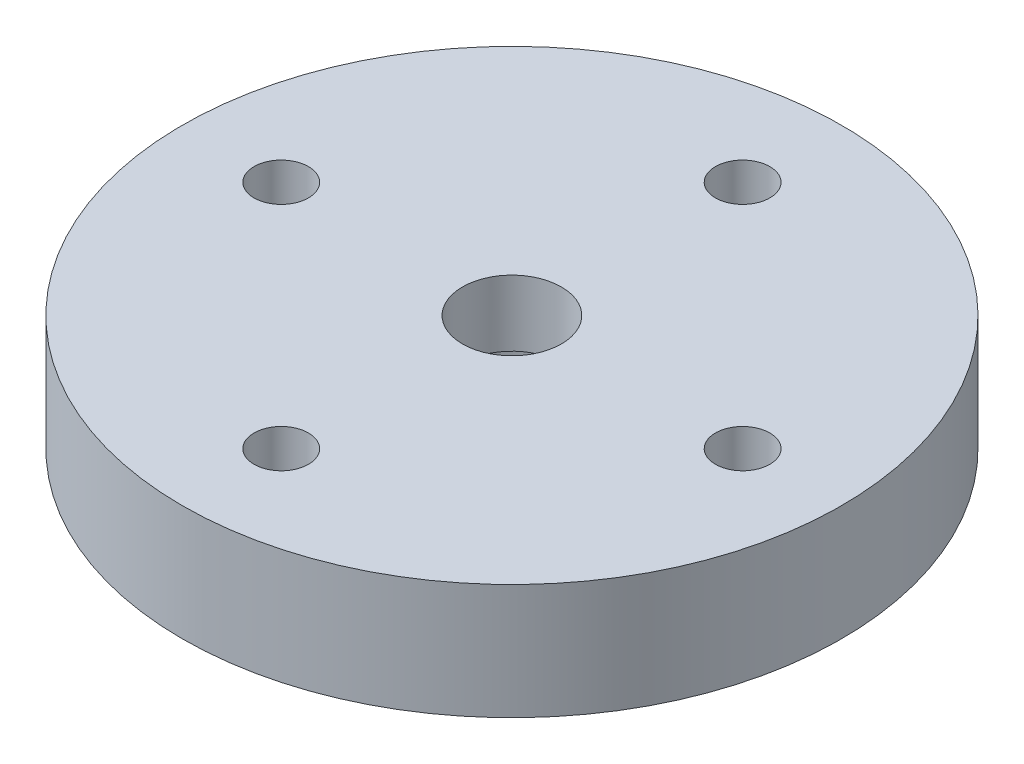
ISO-10303-21;
HEADER;
FILE_DESCRIPTION(('STEP AP214'),'2;1');
FILE_NAME('part.step','',(''),(''),'','','');
FILE_SCHEMA(('AUTOMOTIVE_DESIGN { 1 0 10303 214 1 1 1 1 }'));
ENDSEC;
DATA;
#1=APPLICATION_CONTEXT('core data for automotive mechanical design processes');
#2=APPLICATION_PROTOCOL_DEFINITION('international standard','automotive_design',2000,#1);
#3=PRODUCT_CONTEXT('',#1,'mechanical');
#4=PRODUCT('Part','Part','',(#3));
#5=PRODUCT_RELATED_PRODUCT_CATEGORY('part','',(#4));
#6=PRODUCT_DEFINITION_FORMATION('','',#4);
#7=PRODUCT_DEFINITION_CONTEXT('part definition',#1,'design');
#8=PRODUCT_DEFINITION('design','',#6,#7);
#9=PRODUCT_DEFINITION_SHAPE('','',#8);
#10=(LENGTH_UNIT() NAMED_UNIT(*) SI_UNIT(.MILLI.,.METRE.));
#11=(NAMED_UNIT(*) PLANE_ANGLE_UNIT() SI_UNIT($,.RADIAN.));
#12=(NAMED_UNIT(*) SI_UNIT($,.STERADIAN.) SOLID_ANGLE_UNIT());
#13=UNCERTAINTY_MEASURE_WITH_UNIT(LENGTH_MEASURE(1.E-05),#10,'distance_accuracy_value','');
#14=(GEOMETRIC_REPRESENTATION_CONTEXT(3) GLOBAL_UNCERTAINTY_ASSIGNED_CONTEXT((#13)) GLOBAL_UNIT_ASSIGNED_CONTEXT((#10,
#11,#12)) REPRESENTATION_CONTEXT('',''));
#15=CARTESIAN_POINT('',(0.,0.,0.));
#16=DIRECTION('',(0.,0.,1.));
#17=DIRECTION('',(1.,0.,0.));
#18=AXIS2_PLACEMENT_3D('',#15,#16,#17);
#19=CARTESIAN_POINT('',(0.,3.5,0.));
#20=DIRECTION('',(0.,-1.,0.));
#21=DIRECTION('',(0.,0.,-1.));
#22=AXIS2_PLACEMENT_3D('',#19,#20,#21);
#23=CYLINDRICAL_SURFACE('',#22,1.5);
#24=CARTESIAN_POINT('',(0.,3.5,0.));
#25=DIRECTION('',(0.,1.,0.));
#26=DIRECTION('',(0.,0.,1.));
#27=AXIS2_PLACEMENT_3D('',#24,#25,#26);
#28=CIRCLE('',#27,1.5);
#29=CARTESIAN_POINT('',(0.,3.5,1.5));
#30=VERTEX_POINT('',#29);
#31=EDGE_CURVE('E75',#30,#30,#28,.T.);
#32=ORIENTED_EDGE('',*,*,#31,.T.);
#33=EDGE_LOOP('',(#32));
#34=FACE_BOUND('',#33,.T.);
#35=CARTESIAN_POINT('',(0.,1.5,0.));
#36=DIRECTION('',(0.,-1.,0.));
#37=DIRECTION('',(0.,0.,-1.));
#38=AXIS2_PLACEMENT_3D('',#35,#36,#37);
#39=CIRCLE('',#38,1.5);
#40=CARTESIAN_POINT('',(0.,1.5,-1.5));
#41=VERTEX_POINT('',#40);
#42=EDGE_CURVE('E65',#41,#41,#39,.T.);
#43=ORIENTED_EDGE('',*,*,#42,.T.);
#44=EDGE_LOOP('',(#43));
#45=FACE_BOUND('',#44,.T.);
#46=ADVANCED_FACE('F43',(#34,#45),#23,.F.);
#47=CARTESIAN_POINT('',(0.,0.,0.));
#48=DIRECTION('',(0.,1.,0.));
#49=DIRECTION('',(0.,0.,1.));
#50=AXIS2_PLACEMENT_3D('',#47,#48,#49);
#51=PLANE('',#50);
#52=CARTESIAN_POINT('',(-7.,0.,0.));
#53=DIRECTION('',(0.,1.,0.));
#54=DIRECTION('',(0.,0.,1.));
#55=AXIS2_PLACEMENT_3D('',#52,#53,#54);
#56=CIRCLE('',#55,0.825);
#57=CARTESIAN_POINT('',(-7.,0.,0.824999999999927));
#58=VERTEX_POINT('',#57);
#59=EDGE_CURVE('E107',#58,#58,#56,.T.);
#60=ORIENTED_EDGE('',*,*,#59,.T.);
#61=EDGE_LOOP('',(#60));
#62=FACE_BOUND('',#61,.T.);
#63=CARTESIAN_POINT('',(0.,0.,7.));
#64=DIRECTION('',(0.,1.,0.));
#65=DIRECTION('',(0.,0.,1.));
#66=AXIS2_PLACEMENT_3D('',#63,#64,#65);
#67=CIRCLE('',#66,0.825);
#68=CARTESIAN_POINT('',(0.,0.,7.825));
#69=VERTEX_POINT('',#68);
#70=EDGE_CURVE('E99',#69,#69,#67,.T.);
#71=ORIENTED_EDGE('',*,*,#70,.T.);
#72=EDGE_LOOP('',(#71));
#73=FACE_BOUND('',#72,.T.);
#74=CARTESIAN_POINT('',(7.,0.,0.));
#75=DIRECTION('',(0.,1.,0.));
#76=DIRECTION('',(0.,0.,1.));
#77=AXIS2_PLACEMENT_3D('',#74,#75,#76);
#78=CIRCLE('',#77,0.825);
#79=CARTESIAN_POINT('',(7.,0.,0.825000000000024));
#80=VERTEX_POINT('',#79);
#81=EDGE_CURVE('E91',#80,#80,#78,.T.);
#82=ORIENTED_EDGE('',*,*,#81,.T.);
#83=EDGE_LOOP('',(#82));
#84=FACE_BOUND('',#83,.T.);
#85=CARTESIAN_POINT('',(0.,0.,-7.));
#86=DIRECTION('',(0.,1.,0.));
#87=DIRECTION('',(0.,0.,1.));
#88=AXIS2_PLACEMENT_3D('',#85,#86,#87);
#89=CIRCLE('',#88,0.825);
#90=CARTESIAN_POINT('',(0.,0.,-6.175));
#91=VERTEX_POINT('',#90);
#92=EDGE_CURVE('E83',#91,#91,#89,.T.);
#93=ORIENTED_EDGE('',*,*,#92,.T.);
#94=EDGE_LOOP('',(#93));
#95=FACE_BOUND('',#94,.T.);
#96=CARTESIAN_POINT('',(0.,0.,0.));
#97=DIRECTION('',(0.,1.,0.));
#98=DIRECTION('',(0.,0.,1.));
#99=AXIS2_PLACEMENT_3D('',#96,#97,#98);
#100=CIRCLE('',#99,10.);
#101=CARTESIAN_POINT('',(0.,0.,10.));
#102=VERTEX_POINT('',#101);
#103=EDGE_CURVE('E71',#102,#102,#100,.T.);
#104=ORIENTED_EDGE('',*,*,#103,.F.);
#105=EDGE_LOOP('',(#104));
#106=FACE_BOUND('',#105,.T.);
#107=CARTESIAN_POINT('',(0.,0.,0.));
#108=DIRECTION('',(0.,1.,0.));
#109=DIRECTION('',(0.,0.,1.));
#110=AXIS2_PLACEMENT_3D('',#107,#108,#109);
#111=CIRCLE('',#110,4.5);
#112=CARTESIAN_POINT('',(0.,0.,4.5));
#113=VERTEX_POINT('',#112);
#114=EDGE_CURVE('E57',#113,#113,#111,.F.);
#115=ORIENTED_EDGE('',*,*,#114,.F.);
#116=EDGE_LOOP('',(#115));
#117=FACE_BOUND('',#116,.T.);
#118=ADVANCED_FACE('F138',(#62,#73,#84,#95,#106,#117),#51,.F.);
#119=CARTESIAN_POINT('',(0.,3.5,0.));
#120=DIRECTION('',(0.,1.,0.));
#121=DIRECTION('',(0.,0.,1.));
#122=AXIS2_PLACEMENT_3D('',#119,#120,#121);
#123=PLANE('',#122);
#124=CARTESIAN_POINT('',(0.,3.5,7.));
#125=DIRECTION('',(0.,1.,0.));
#126=DIRECTION('',(0.,0.,1.));
#127=AXIS2_PLACEMENT_3D('',#124,#125,#126);
#128=CIRCLE('',#127,0.825);
#129=CARTESIAN_POINT('',(0.,3.5,7.825));
#130=VERTEX_POINT('',#129);
#131=EDGE_CURVE('E95',#130,#130,#128,.T.);
#132=ORIENTED_EDGE('',*,*,#131,.F.);
#133=EDGE_LOOP('',(#132));
#134=FACE_BOUND('',#133,.T.);
#135=CARTESIAN_POINT('',(0.,3.5,-7.));
#136=DIRECTION('',(0.,1.,0.));
#137=DIRECTION('',(0.,0.,1.));
#138=AXIS2_PLACEMENT_3D('',#135,#136,#137);
#139=CIRCLE('',#138,0.825);
#140=CARTESIAN_POINT('',(0.,3.5,-6.175));
#141=VERTEX_POINT('',#140);
#142=EDGE_CURVE('E82',#141,#141,#139,.T.);
#143=ORIENTED_EDGE('',*,*,#142,.F.);
#144=EDGE_LOOP('',(#143));
#145=FACE_BOUND('',#144,.T.);
#146=CARTESIAN_POINT('',(0.,3.5,0.));
#147=DIRECTION('',(0.,1.,0.));
#148=DIRECTION('',(0.,0.,1.));
#149=AXIS2_PLACEMENT_3D('',#146,#147,#148);
#150=CIRCLE('',#149,10.);
#151=CARTESIAN_POINT('',(0.,3.5,10.));
#152=VERTEX_POINT('',#151);
#153=EDGE_CURVE('E62',#152,#152,#150,.T.);
#154=ORIENTED_EDGE('',*,*,#153,.T.);
#155=EDGE_LOOP('',(#154));
#156=FACE_BOUND('',#155,.T.);
#157=ORIENTED_EDGE('',*,*,#31,.F.);
#158=EDGE_LOOP('',(#157));
#159=FACE_BOUND('',#158,.T.);
#160=CARTESIAN_POINT('',(7.,3.5,0.));
#161=DIRECTION('',(0.,1.,0.));
#162=DIRECTION('',(0.,0.,1.));
#163=AXIS2_PLACEMENT_3D('',#160,#161,#162);
#164=CIRCLE('',#163,0.825);
#165=CARTESIAN_POINT('',(7.,3.5,0.825000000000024));
#166=VERTEX_POINT('',#165);
#167=EDGE_CURVE('E87',#166,#166,#164,.T.);
#168=ORIENTED_EDGE('',*,*,#167,.F.);
#169=EDGE_LOOP('',(#168));
#170=FACE_BOUND('',#169,.T.);
#171=CARTESIAN_POINT('',(-7.,3.5,0.));
#172=DIRECTION('',(0.,1.,0.));
#173=DIRECTION('',(0.,0.,1.));
#174=AXIS2_PLACEMENT_3D('',#171,#172,#173);
#175=CIRCLE('',#174,0.825);
#176=CARTESIAN_POINT('',(-7.,3.5,0.824999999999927));
#177=VERTEX_POINT('',#176);
#178=EDGE_CURVE('E103',#177,#177,#175,.T.);
#179=ORIENTED_EDGE('',*,*,#178,.F.);
#180=EDGE_LOOP('',(#179));
#181=FACE_BOUND('',#180,.T.);
#182=ADVANCED_FACE('F144',(#134,#145,#156,#159,#170,#181),#123,.T.);
#183=CARTESIAN_POINT('',(0.,3.5,0.));
#184=DIRECTION('',(0.,-1.,0.));
#185=DIRECTION('',(0.,0.,-1.));
#186=AXIS2_PLACEMENT_3D('',#183,#184,#185);
#187=CYLINDRICAL_SURFACE('',#186,10.);
#188=ORIENTED_EDGE('',*,*,#153,.F.);
#189=EDGE_LOOP('',(#188));
#190=FACE_BOUND('',#189,.T.);
#191=ORIENTED_EDGE('',*,*,#103,.T.);
#192=EDGE_LOOP('',(#191));
#193=FACE_BOUND('',#192,.T.);
#194=ADVANCED_FACE('F153',(#190,#193),#187,.T.);
#195=CARTESIAN_POINT('',(0.,3.5,-7.));
#196=DIRECTION('',(0.,-1.,0.));
#197=DIRECTION('',(0.,0.,-1.));
#198=AXIS2_PLACEMENT_3D('',#195,#196,#197);
#199=CYLINDRICAL_SURFACE('',#198,0.825);
#200=ORIENTED_EDGE('',*,*,#142,.T.);
#201=EDGE_LOOP('',(#200));
#202=FACE_BOUND('',#201,.T.);
#203=ORIENTED_EDGE('',*,*,#92,.F.);
#204=EDGE_LOOP('',(#203));
#205=FACE_BOUND('',#204,.T.);
#206=ADVANCED_FACE('F150',(#202,#205),#199,.F.);
#207=CARTESIAN_POINT('',(7.,3.5,0.));
#208=DIRECTION('',(0.,-1.,0.));
#209=DIRECTION('',(0.,0.,-1.));
#210=AXIS2_PLACEMENT_3D('',#207,#208,#209);
#211=CYLINDRICAL_SURFACE('',#210,0.825);
#212=ORIENTED_EDGE('',*,*,#167,.T.);
#213=EDGE_LOOP('',(#212));
#214=FACE_BOUND('',#213,.T.);
#215=ORIENTED_EDGE('',*,*,#81,.F.);
#216=EDGE_LOOP('',(#215));
#217=FACE_BOUND('',#216,.T.);
#218=ADVANCED_FACE('F160',(#214,#217),#211,.F.);
#219=CARTESIAN_POINT('',(0.,3.5,7.));
#220=DIRECTION('',(0.,-1.,0.));
#221=DIRECTION('',(0.,0.,-1.));
#222=AXIS2_PLACEMENT_3D('',#219,#220,#221);
#223=CYLINDRICAL_SURFACE('',#222,0.825);
#224=ORIENTED_EDGE('',*,*,#131,.T.);
#225=EDGE_LOOP('',(#224));
#226=FACE_BOUND('',#225,.T.);
#227=ORIENTED_EDGE('',*,*,#70,.F.);
#228=EDGE_LOOP('',(#227));
#229=FACE_BOUND('',#228,.T.);
#230=ADVANCED_FACE('F180',(#226,#229),#223,.F.);
#231=CARTESIAN_POINT('',(-7.,3.5,0.));
#232=DIRECTION('',(0.,-1.,0.));
#233=DIRECTION('',(0.,0.,-1.));
#234=AXIS2_PLACEMENT_3D('',#231,#232,#233);
#235=CYLINDRICAL_SURFACE('',#234,0.825);
#236=ORIENTED_EDGE('',*,*,#178,.T.);
#237=EDGE_LOOP('',(#236));
#238=FACE_BOUND('',#237,.T.);
#239=ORIENTED_EDGE('',*,*,#59,.F.);
#240=EDGE_LOOP('',(#239));
#241=FACE_BOUND('',#240,.T.);
#242=ADVANCED_FACE('F177',(#238,#241),#235,.F.);
#243=CARTESIAN_POINT('',(0.,-2.,0.));
#244=DIRECTION('',(0.,-1.,0.));
#245=DIRECTION('',(0.,0.,-1.));
#246=AXIS2_PLACEMENT_3D('',#243,#244,#245);
#247=PLANE('',#246);
#248=CARTESIAN_POINT('',(0.,-2.,0.));
#249=DIRECTION('',(0.,-1.,0.));
#250=DIRECTION('',(0.,0.,-1.));
#251=AXIS2_PLACEMENT_3D('',#248,#249,#250);
#252=CIRCLE('',#251,3.5);
#253=CARTESIAN_POINT('',(0.,-2.,-3.5));
#254=VERTEX_POINT('',#253);
#255=EDGE_CURVE('E10',#254,#254,#252,.F.);
#256=ORIENTED_EDGE('',*,*,#255,.T.);
#257=EDGE_LOOP('',(#256));
#258=FACE_BOUND('',#257,.T.);
#259=CARTESIAN_POINT('',(0.,-2.,0.));
#260=DIRECTION('',(0.,-1.,0.));
#261=DIRECTION('',(0.,0.,-1.));
#262=AXIS2_PLACEMENT_3D('',#259,#260,#261);
#263=CIRCLE('',#262,4.5);
#264=CARTESIAN_POINT('',(0.,-2.,-4.5));
#265=VERTEX_POINT('',#264);
#266=EDGE_CURVE('E68',#265,#265,#263,.T.);
#267=ORIENTED_EDGE('',*,*,#266,.T.);
#268=EDGE_LOOP('',(#267));
#269=FACE_BOUND('',#268,.T.);
#270=ADVANCED_FACE('F133',(#258,#269),#247,.T.);
#271=CARTESIAN_POINT('',(0.,-2.,0.));
#272=DIRECTION('',(0.,1.,0.));
#273=DIRECTION('',(0.,0.,1.));
#274=AXIS2_PLACEMENT_3D('',#271,#272,#273);
#275=CYLINDRICAL_SURFACE('',#274,4.5);
#276=ORIENTED_EDGE('',*,*,#266,.F.);
#277=EDGE_LOOP('',(#276));
#278=FACE_BOUND('',#277,.T.);
#279=ORIENTED_EDGE('',*,*,#114,.T.);
#280=EDGE_LOOP('',(#279));
#281=FACE_BOUND('',#280,.T.);
#282=ADVANCED_FACE('F125',(#278,#281),#275,.T.);
#283=CARTESIAN_POINT('',(0.,1.5,0.));
#284=DIRECTION('',(0.,-1.,0.));
#285=DIRECTION('',(0.,0.,-1.));
#286=AXIS2_PLACEMENT_3D('',#283,#284,#285);
#287=CYLINDRICAL_SURFACE('',#286,3.);
#288=CARTESIAN_POINT('',(0.,-1.5,0.));
#289=DIRECTION('',(0.,-1.,0.));
#290=DIRECTION('',(0.,0.,-1.));
#291=AXIS2_PLACEMENT_3D('',#288,#289,#290);
#292=CIRCLE('',#291,3.);
#293=CARTESIAN_POINT('',(0.,-1.5,-3.));
#294=VERTEX_POINT('',#293);
#295=EDGE_CURVE('E52',#294,#294,#292,.T.);
#296=ORIENTED_EDGE('',*,*,#295,.T.);
#297=EDGE_LOOP('',(#296));
#298=FACE_BOUND('',#297,.T.);
#299=CARTESIAN_POINT('',(0.,1.5,0.));
#300=DIRECTION('',(0.,-1.,0.));
#301=DIRECTION('',(0.,0.,-1.));
#302=AXIS2_PLACEMENT_3D('',#299,#300,#301);
#303=CIRCLE('',#302,3.);
#304=CARTESIAN_POINT('',(0.,1.5,-3.));
#305=VERTEX_POINT('',#304);
#306=EDGE_CURVE('E69',#305,#305,#303,.T.);
#307=ORIENTED_EDGE('',*,*,#306,.F.);
#308=EDGE_LOOP('',(#307));
#309=FACE_BOUND('',#308,.T.);
#310=ADVANCED_FACE('F123',(#298,#309),#287,.F.);
#311=CARTESIAN_POINT('',(0.,1.5,0.));
#312=DIRECTION('',(0.,-1.,0.));
#313=DIRECTION('',(0.,0.,-1.));
#314=AXIS2_PLACEMENT_3D('',#311,#312,#313);
#315=PLANE('',#314);
#316=ORIENTED_EDGE('',*,*,#42,.F.);
#317=EDGE_LOOP('',(#316));
#318=FACE_BOUND('',#317,.T.);
#319=ORIENTED_EDGE('',*,*,#306,.T.);
#320=EDGE_LOOP('',(#319));
#321=FACE_BOUND('',#320,.T.);
#322=ADVANCED_FACE('F121',(#318,#321),#315,.T.);
#323=CARTESIAN_POINT('',(0.,-1.5,0.));
#324=DIRECTION('',(0.,-1.,0.));
#325=DIRECTION('',(0.,0.,-1.));
#326=AXIS2_PLACEMENT_3D('',#323,#324,#325);
#327=CONICAL_SURFACE('',#326,3.,0.785398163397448);
#328=ORIENTED_EDGE('',*,*,#255,.F.);
#329=EDGE_LOOP('',(#328));
#330=FACE_BOUND('',#329,.T.);
#331=ORIENTED_EDGE('',*,*,#295,.F.);
#332=EDGE_LOOP('',(#331));
#333=FACE_BOUND('',#332,.T.);
#334=ADVANCED_FACE('F46',(#330,#333),#327,.F.);
#335=CLOSED_SHELL('',(#46,#118,#182,#194,#206,#218,#230,#242,#270,#282,#310,#322,#334));
#336=MANIFOLD_SOLID_BREP('B2',#335);
#337=ADVANCED_BREP_SHAPE_REPRESENTATION('',(#18,#336),#14);
#338=SHAPE_DEFINITION_REPRESENTATION(#9,#337);
ENDSEC;
END-ISO-10303-21;
